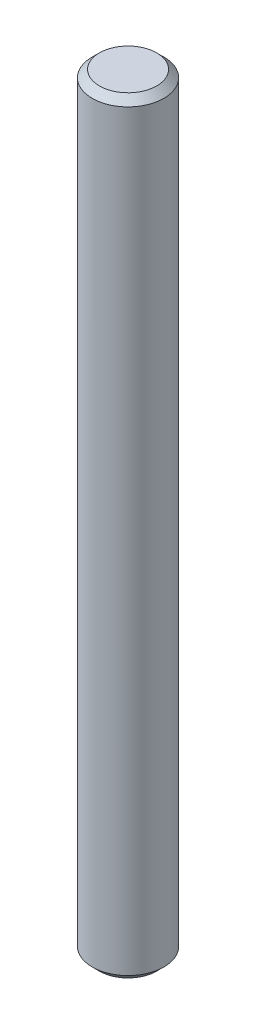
ISO-10303-21;
HEADER;
FILE_DESCRIPTION(('STEP AP214'),'2;1');
FILE_NAME('part.step','',(''),(''),'','','');
FILE_SCHEMA(('AUTOMOTIVE_DESIGN { 1 0 10303 214 1 1 1 1 }'));
ENDSEC;
DATA;
#1=APPLICATION_CONTEXT('core data for automotive mechanical design processes');
#2=APPLICATION_PROTOCOL_DEFINITION('international standard','automotive_design',2000,#1);
#3=PRODUCT_CONTEXT('',#1,'mechanical');
#4=PRODUCT('Part','Part','',(#3));
#5=PRODUCT_RELATED_PRODUCT_CATEGORY('part','',(#4));
#6=PRODUCT_DEFINITION_FORMATION('','',#4);
#7=PRODUCT_DEFINITION_CONTEXT('part definition',#1,'design');
#8=PRODUCT_DEFINITION('design','',#6,#7);
#9=PRODUCT_DEFINITION_SHAPE('','',#8);
#10=(LENGTH_UNIT() NAMED_UNIT(*) SI_UNIT(.MILLI.,.METRE.));
#11=(NAMED_UNIT(*) PLANE_ANGLE_UNIT() SI_UNIT($,.RADIAN.));
#12=(NAMED_UNIT(*) SI_UNIT($,.STERADIAN.) SOLID_ANGLE_UNIT());
#13=UNCERTAINTY_MEASURE_WITH_UNIT(LENGTH_MEASURE(1.E-05),#10,'distance_accuracy_value','');
#14=(GEOMETRIC_REPRESENTATION_CONTEXT(3) GLOBAL_UNCERTAINTY_ASSIGNED_CONTEXT((#13)) GLOBAL_UNIT_ASSIGNED_CONTEXT((#10,
#11,#12)) REPRESENTATION_CONTEXT('',''));
#15=CARTESIAN_POINT('',(0.,0.,0.));
#16=DIRECTION('',(0.,0.,1.));
#17=DIRECTION('',(1.,0.,0.));
#18=AXIS2_PLACEMENT_3D('',#15,#16,#17);
#19=CARTESIAN_POINT('',(0.,53.5,0.));
#20=DIRECTION('',(0.,1.,0.));
#21=DIRECTION('',(0.,0.,1.));
#22=AXIS2_PLACEMENT_3D('',#19,#20,#21);
#23=PLANE('',#22);
#24=CARTESIAN_POINT('',(0.,53.5000000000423,0.));
#25=DIRECTION('',(0.,-1.,0.));
#26=DIRECTION('',(1.,0.,0.));
#27=AXIS2_PLACEMENT_3D('',#24,#25,#26);
#28=CIRCLE('',#27,1.99999999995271);
#29=CARTESIAN_POINT('',(1.99999999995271,53.5000000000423,0.));
#30=VERTEX_POINT('',#29);
#31=EDGE_CURVE('E18',#30,#30,#28,.T.);
#32=ORIENTED_EDGE('',*,*,#31,.F.);
#33=EDGE_LOOP('',(#32));
#34=FACE_BOUND('',#33,.T.);
#35=ADVANCED_FACE('F15',(#34),#23,.T.);
#36=CARTESIAN_POINT('',(0.,0.,0.));
#37=DIRECTION('',(0.,1.,0.));
#38=DIRECTION('',(0.,0.,1.));
#39=AXIS2_PLACEMENT_3D('',#36,#37,#38);
#40=PLANE('',#39);
#41=CARTESIAN_POINT('',(0.,0.,0.));
#42=DIRECTION('',(0.,1.,0.));
#43=DIRECTION('',(0.,0.,1.));
#44=AXIS2_PLACEMENT_3D('',#41,#42,#43);
#45=CIRCLE('',#44,2.00000000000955);
#46=CARTESIAN_POINT('',(0.,0.,2.00000000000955));
#47=VERTEX_POINT('',#46);
#48=EDGE_CURVE('E27',#47,#47,#45,.T.);
#49=ORIENTED_EDGE('',*,*,#48,.F.);
#50=EDGE_LOOP('',(#49));
#51=FACE_BOUND('',#50,.T.);
#52=ADVANCED_FACE('F38',(#51),#40,.F.);
#53=CARTESIAN_POINT('',(0.,53.0000000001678,0.));
#54=DIRECTION('',(0.,-1.,0.));
#55=DIRECTION('',(1.,0.,0.));
#56=AXIS2_PLACEMENT_3D('',#53,#54,#55);
#57=CONICAL_SURFACE('',#56,2.4999999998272,0.785398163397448);
#58=CARTESIAN_POINT('',(0.,53.,0.));
#59=DIRECTION('',(0.,-1.,0.));
#60=DIRECTION('',(0.,0.,-1.));
#61=AXIS2_PLACEMENT_3D('',#58,#59,#60);
#62=CIRCLE('',#61,2.5);
#63=CARTESIAN_POINT('',(0.,53.,-2.5));
#64=VERTEX_POINT('',#63);
#65=EDGE_CURVE('E22',#64,#64,#62,.T.);
#66=ORIENTED_EDGE('',*,*,#65,.F.);
#67=EDGE_LOOP('',(#66));
#68=FACE_BOUND('',#67,.T.);
#69=ORIENTED_EDGE('',*,*,#31,.T.);
#70=EDGE_LOOP('',(#69));
#71=FACE_BOUND('',#70,.T.);
#72=ADVANCED_FACE('F35',(#68,#71),#57,.T.);
#73=CARTESIAN_POINT('',(0.,0.50000000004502,0.));
#74=DIRECTION('',(0.,1.,0.));
#75=DIRECTION('',(0.,0.,1.));
#76=AXIS2_PLACEMENT_3D('',#73,#74,#75);
#77=CONICAL_SURFACE('',#76,2.50000000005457,0.785398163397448);
#78=CARTESIAN_POINT('',(0.,0.499999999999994,0.));
#79=DIRECTION('',(0.,-1.,0.));
#80=DIRECTION('',(0.,0.,-1.));
#81=AXIS2_PLACEMENT_3D('',#78,#79,#80);
#82=CIRCLE('',#81,2.5);
#83=CARTESIAN_POINT('',(0.,0.499999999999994,-2.5));
#84=VERTEX_POINT('',#83);
#85=EDGE_CURVE('E10',#84,#84,#82,.F.);
#86=ORIENTED_EDGE('',*,*,#85,.F.);
#87=EDGE_LOOP('',(#86));
#88=FACE_BOUND('',#87,.T.);
#89=ORIENTED_EDGE('',*,*,#48,.T.);
#90=EDGE_LOOP('',(#89));
#91=FACE_BOUND('',#90,.T.);
#92=ADVANCED_FACE('F46',(#88,#91),#77,.T.);
#93=CARTESIAN_POINT('',(0.,53.5,0.));
#94=DIRECTION('',(0.,-1.,0.));
#95=DIRECTION('',(0.,0.,-1.));
#96=AXIS2_PLACEMENT_3D('',#93,#94,#95);
#97=CYLINDRICAL_SURFACE('',#96,2.5);
#98=ORIENTED_EDGE('',*,*,#85,.T.);
#99=EDGE_LOOP('',(#98));
#100=FACE_BOUND('',#99,.T.);
#101=ORIENTED_EDGE('',*,*,#65,.T.);
#102=EDGE_LOOP('',(#101));
#103=FACE_BOUND('',#102,.T.);
#104=ADVANCED_FACE('F44',(#100,#103),#97,.T.);
#105=CLOSED_SHELL('',(#35,#52,#72,#92,#104));
#106=MANIFOLD_SOLID_BREP('B1',#105);
#107=ADVANCED_BREP_SHAPE_REPRESENTATION('',(#18,#106),#14);
#108=SHAPE_DEFINITION_REPRESENTATION(#9,#107);
ENDSEC;
END-ISO-10303-21;
